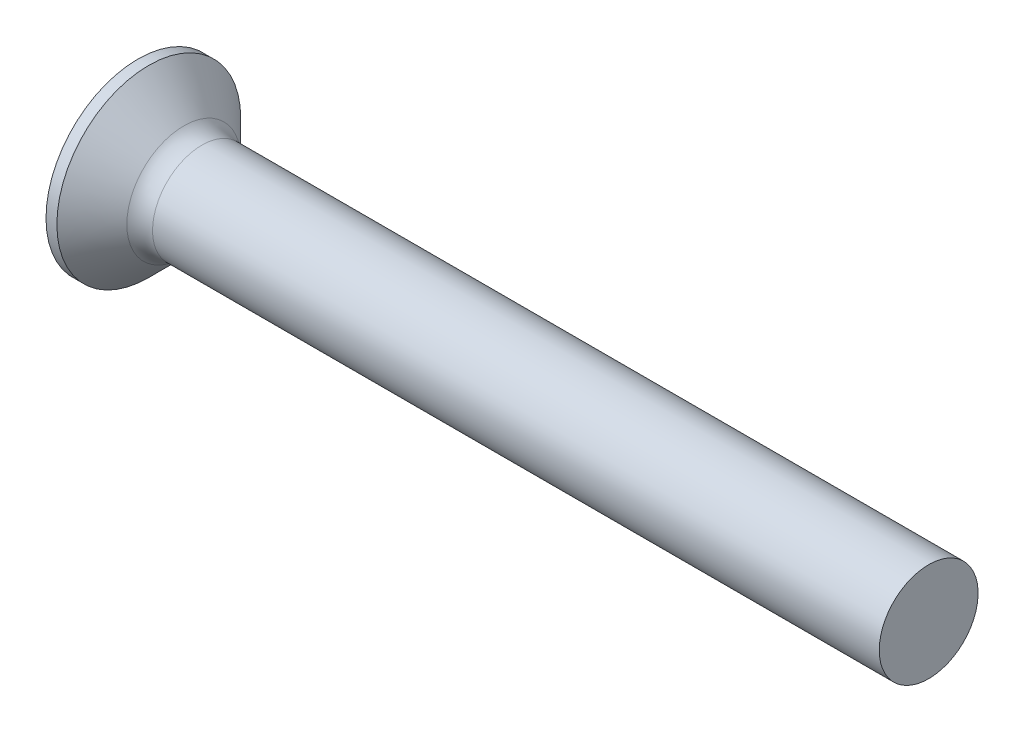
from build123d import *

# Parameters (mm, degrees)
FILLET1_R    = 1.3
RECPAT_COUNT = 2
RECPAT_ANGLE = 90


with BuildPart() as part:
    # BodySke → Base-Revolve (revolve)
    with BuildSketch(Plane.XY, mode=Mode.PRIVATE) as base_revolve_sk:
        Polygon((0, 0), (0, 4.65), (0.55, 4.65), (2.7, 2.5), (40, 2.5), (40, 0), align=None)
    revolve(base_revolve_sk.sketch.rotate(Axis((-6.35, 0, 0), (1, 0, 0)), 90), axis=Axis((-6.35, 0, 0), (1, 0, 0)))

    # Fillet1
    fillet1_edges = [part.edges().sort_by_distance(p)[0] for p in [
        (2.7, 0, -2.5),
    ]]
    fillet(fillet1_edges, radius=FILLET1_R)

    # Sketch3 → Recess section 0
    with BuildSketch(Plane.ZY):
        with BuildLine():
            Line((-0.515, 2.45), (0.515, 2.45))
            Line((0.515, 2.45), (0.515, -2.45))
            Line((0.515, -2.45), (-0.515, -2.45))
            Line((-0.515, -2.45), (-0.515, 2.45))
        make_face()
    # Sketch4 → Recess section 1
    with BuildSketch(Plane.ZY.offset(-3.05)):
        with BuildLine():
            Line((-0.515, 0.929326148), (0.515, 0.929326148))
            Line((0.515, 0.929326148), (0.515, -0.929326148))
            Line((0.515, -0.929326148), (-0.515, -0.929326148))
            Line((-0.515, -0.929326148), (-0.515, 0.929326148))
        make_face()
    recess = loft(mode=Mode.SUBTRACT)

    # RecPat: Recess ×2 about axis
    recpat_axis = Axis((0, 0, 0), (1, 0, 0))
    for i in range(1, RECPAT_COUNT):
        add(recess.rotate(recpat_axis, i * RECPAT_ANGLE / (RECPAT_COUNT - 1)), mode=Mode.SUBTRACT)

    # RecCorSke → RecessCore (revolve, cut)
    with BuildSketch(Plane.XY, mode=Mode.PRIVATE) as recesscore_sk:
        Polygon((0, 0), (0, 1.064276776), (3.05, 0.851), (3.326506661, 0), align=None)
    revolve(recesscore_sk.sketch.rotate(Axis((-3.175, 0, 0), (1, 0, 0)), 90), axis=Axis((-3.175, 0, 0), (1, 0, 0)), mode=Mode.SUBTRACT)


solid = part.part
